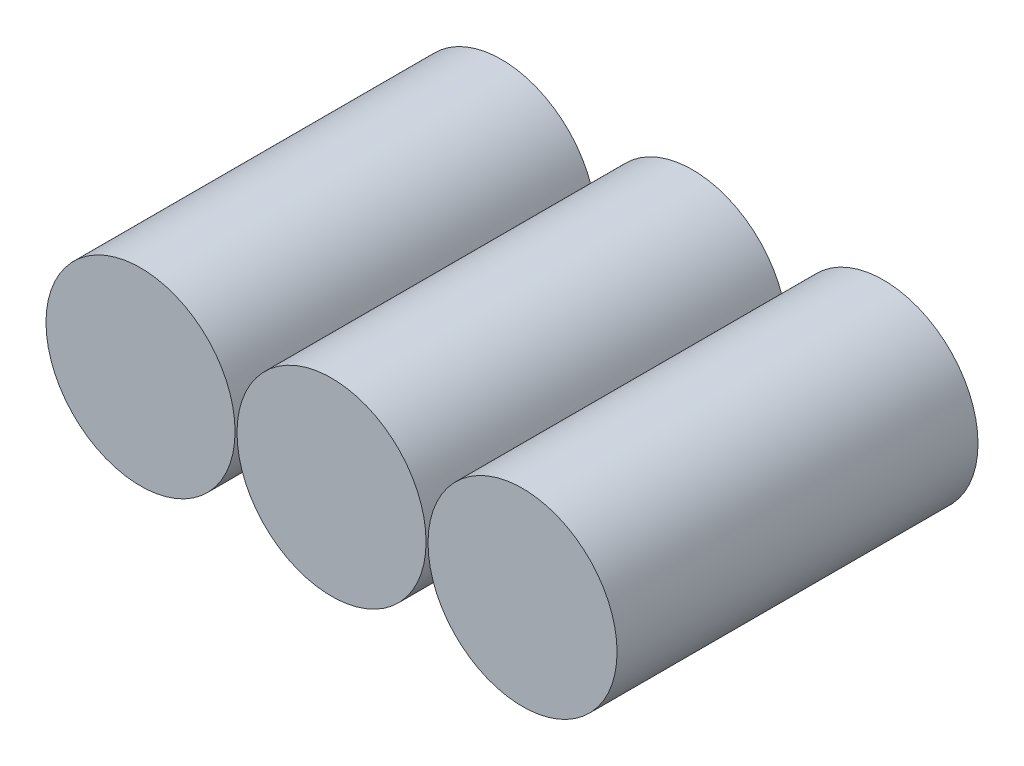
from build123d import *

# Parameters (mm, degrees)
ESQUISSE1_R                = 11
EXTRUSION1_DEPTH           = 21
R_P_TITION_LIN_AIRE1_COUNT = 3
R_P_TITION_LIN_AIRE1_PITCH = 22.2266667


with BuildPart() as part:
    # Esquisse1 → Extrusion1 (new, symmetric)
    with BuildSketch(Plane.XY):
        with Locations(Location((0, 0, 0), (0, 0, 180))):
            Circle(ESQUISSE1_R)
    extrude(amount=EXTRUSION1_DEPTH, both=True)


with BuildPart() as r_p_tition_lin_aire1_1:
    # R_p_tition lin_aire1: pattern copy
    add(part.part.moved(Location(Vector(1, 0, 0) * (1 * R_P_TITION_LIN_AIRE1_PITCH))))


with BuildPart() as r_p_tition_lin_aire1_2:
    # R_p_tition lin_aire1: pattern copy
    add(part.part.moved(Location(Vector(1, 0, 0) * (2 * R_P_TITION_LIN_AIRE1_PITCH))))


solid = Compound([part.part, r_p_tition_lin_aire1_1.part, r_p_tition_lin_aire1_2.part])
